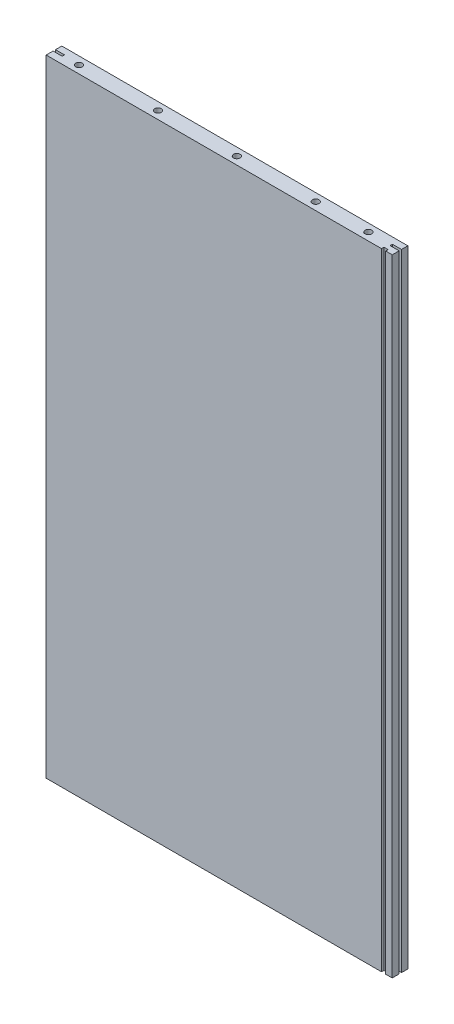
ISO-10303-21;
HEADER;
FILE_DESCRIPTION(('STEP AP214'),'2;1');
FILE_NAME('part.step','',(''),(''),'','','');
FILE_SCHEMA(('AUTOMOTIVE_DESIGN { 1 0 10303 214 1 1 1 1 }'));
ENDSEC;
DATA;
#1=APPLICATION_CONTEXT('core data for automotive mechanical design processes');
#2=APPLICATION_PROTOCOL_DEFINITION('international standard','automotive_design',2000,#1);
#3=PRODUCT_CONTEXT('',#1,'mechanical');
#4=PRODUCT('Part','Part','',(#3));
#5=PRODUCT_RELATED_PRODUCT_CATEGORY('part','',(#4));
#6=PRODUCT_DEFINITION_FORMATION('','',#4);
#7=PRODUCT_DEFINITION_CONTEXT('part definition',#1,'design');
#8=PRODUCT_DEFINITION('design','',#6,#7);
#9=PRODUCT_DEFINITION_SHAPE('','',#8);
#10=(LENGTH_UNIT() NAMED_UNIT(*) SI_UNIT(.MILLI.,.METRE.));
#11=(NAMED_UNIT(*) PLANE_ANGLE_UNIT() SI_UNIT($,.RADIAN.));
#12=(NAMED_UNIT(*) SI_UNIT($,.STERADIAN.) SOLID_ANGLE_UNIT());
#13=UNCERTAINTY_MEASURE_WITH_UNIT(LENGTH_MEASURE(1.E-05),#10,'distance_accuracy_value','');
#14=(GEOMETRIC_REPRESENTATION_CONTEXT(3) GLOBAL_UNCERTAINTY_ASSIGNED_CONTEXT((#13)) GLOBAL_UNIT_ASSIGNED_CONTEXT((#10,
#11,#12)) REPRESENTATION_CONTEXT('',''));
#15=CARTESIAN_POINT('',(0.,0.,0.));
#16=DIRECTION('',(0.,0.,1.));
#17=DIRECTION('',(1.,0.,0.));
#18=AXIS2_PLACEMENT_3D('',#15,#16,#17);
#19=CARTESIAN_POINT('',(-210.5,381.,19.));
#20=DIRECTION('',(0.,-1.,0.));
#21=DIRECTION('',(0.,0.,-1.));
#22=AXIS2_PLACEMENT_3D('',#19,#20,#21);
#23=PLANE('',#22);
#24=CARTESIAN_POINT('',(172.,381.,9.5));
#25=DIRECTION('',(0.,1.,0.));
#26=DIRECTION('',(0.,0.,1.));
#27=AXIS2_PLACEMENT_3D('',#24,#25,#26);
#28=CIRCLE('',#27,3.99999999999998);
#29=CARTESIAN_POINT('',(172.,381.,13.5));
#30=VERTEX_POINT('',#29);
#31=EDGE_CURVE('E281',#30,#30,#28,.T.);
#32=ORIENTED_EDGE('',*,*,#31,.F.);
#33=EDGE_LOOP('',(#32));
#34=FACE_BOUND('',#33,.T.);
#35=CARTESIAN_POINT('',(12.,381.,9.5));
#36=DIRECTION('',(0.,1.,0.));
#37=DIRECTION('',(0.,0.,1.));
#38=AXIS2_PLACEMENT_3D('',#35,#36,#37);
#39=CIRCLE('',#38,3.99999999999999);
#40=CARTESIAN_POINT('',(12.,381.,13.5));
#41=VERTEX_POINT('',#40);
#42=EDGE_CURVE('E298',#41,#41,#39,.T.);
#43=ORIENTED_EDGE('',*,*,#42,.F.);
#44=EDGE_LOOP('',(#43));
#45=FACE_BOUND('',#44,.T.);
#46=CARTESIAN_POINT('',(-84.,381.,9.5));
#47=DIRECTION('',(0.,1.,0.));
#48=DIRECTION('',(0.,0.,1.));
#49=AXIS2_PLACEMENT_3D('',#46,#47,#48);
#50=CIRCLE('',#49,3.99999999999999);
#51=CARTESIAN_POINT('',(-84.,381.,13.5));
#52=VERTEX_POINT('',#51);
#53=EDGE_CURVE('E304',#52,#52,#50,.T.);
#54=ORIENTED_EDGE('',*,*,#53,.F.);
#55=EDGE_LOOP('',(#54));
#56=FACE_BOUND('',#55,.T.);
#57=CARTESIAN_POINT('',(-180.,381.,9.5));
#58=DIRECTION('',(0.,1.,0.));
#59=DIRECTION('',(0.,0.,1.));
#60=AXIS2_PLACEMENT_3D('',#57,#58,#59);
#61=CIRCLE('',#60,4.);
#62=CARTESIAN_POINT('',(-180.,381.,13.5));
#63=VERTEX_POINT('',#62);
#64=EDGE_CURVE('E310',#63,#63,#61,.T.);
#65=ORIENTED_EDGE('',*,*,#64,.F.);
#66=EDGE_LOOP('',(#65));
#67=FACE_BOUND('',#66,.T.);
#68=CARTESIAN_POINT('',(108.,381.,9.5));
#69=DIRECTION('',(0.,1.,0.));
#70=DIRECTION('',(0.,0.,1.));
#71=AXIS2_PLACEMENT_3D('',#68,#69,#70);
#72=CIRCLE('',#71,3.99999999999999);
#73=CARTESIAN_POINT('',(108.,381.,13.5));
#74=VERTEX_POINT('',#73);
#75=EDGE_CURVE('E292',#74,#74,#72,.T.);
#76=ORIENTED_EDGE('',*,*,#75,.F.);
#77=EDGE_LOOP('',(#76));
#78=FACE_BOUND('',#77,.T.);
#79=DIRECTION('',(-1.,0.,0.));
#80=VECTOR('',#79,1.);
#81=CARTESIAN_POINT('',(199.5,381.,7.7));
#82=LINE('',#81,#80);
#83=CARTESIAN_POINT('',(210.5,381.,7.7));
#84=VERTEX_POINT('',#83);
#85=CARTESIAN_POINT('',(199.5,381.,7.7));
#86=VERTEX_POINT('',#85);
#87=EDGE_CURVE('E192',#84,#86,#82,.T.);
#88=ORIENTED_EDGE('',*,*,#87,.F.);
#89=DIRECTION('',(0.,0.,-1.));
#90=VECTOR('',#89,1.);
#91=CARTESIAN_POINT('',(210.5,381.,19.));
#92=LINE('',#91,#90);
#93=CARTESIAN_POINT('',(210.5,381.,0.));
#94=VERTEX_POINT('',#93);
#95=EDGE_CURVE('E41',#84,#94,#92,.T.);
#96=ORIENTED_EDGE('',*,*,#95,.T.);
#97=DIRECTION('',(-1.,0.,0.));
#98=VECTOR('',#97,1.);
#99=CARTESIAN_POINT('',(-210.5,381.,0.));
#100=LINE('',#99,#98);
#101=CARTESIAN_POINT('',(-210.5,381.,0.));
#102=VERTEX_POINT('',#101);
#103=EDGE_CURVE('E228',#94,#102,#100,.T.);
#104=ORIENTED_EDGE('',*,*,#103,.T.);
#105=DIRECTION('',(0.,0.,-1.));
#106=VECTOR('',#105,1.);
#107=CARTESIAN_POINT('',(-210.5,381.,19.));
#108=LINE('',#107,#106);
#109=CARTESIAN_POINT('',(-210.5,381.,7.7));
#110=VERTEX_POINT('',#109);
#111=EDGE_CURVE('E238',#110,#102,#108,.T.);
#112=ORIENTED_EDGE('',*,*,#111,.F.);
#113=DIRECTION('',(1.,0.,0.));
#114=VECTOR('',#113,1.);
#115=CARTESIAN_POINT('',(-199.5,381.,7.7));
#116=LINE('',#115,#114);
#117=CARTESIAN_POINT('',(-199.5,381.,7.7));
#118=VERTEX_POINT('',#117);
#119=EDGE_CURVE('E278',#110,#118,#116,.T.);
#120=ORIENTED_EDGE('',*,*,#119,.T.);
#121=DIRECTION('',(0.,0.,1.));
#122=VECTOR('',#121,1.);
#123=CARTESIAN_POINT('',(-199.5,381.,10.6));
#124=LINE('',#123,#122);
#125=CARTESIAN_POINT('',(-199.5,381.,10.6));
#126=VERTEX_POINT('',#125);
#127=EDGE_CURVE('E385',#118,#126,#124,.T.);
#128=ORIENTED_EDGE('',*,*,#127,.T.);
#129=DIRECTION('',(-1.,0.,0.));
#130=VECTOR('',#129,1.);
#131=CARTESIAN_POINT('',(-210.5,381.,10.6));
#132=LINE('',#131,#130);
#133=CARTESIAN_POINT('',(-210.5,381.,10.6));
#134=VERTEX_POINT('',#133);
#135=EDGE_CURVE('E274',#126,#134,#132,.T.);
#136=ORIENTED_EDGE('',*,*,#135,.T.);
#137=CARTESIAN_POINT('',(-210.5,381.,19.));
#138=VERTEX_POINT('',#137);
#139=EDGE_CURVE('E239',#138,#134,#108,.T.);
#140=ORIENTED_EDGE('',*,*,#139,.F.);
#141=DIRECTION('',(-1.,0.,0.));
#142=VECTOR('',#141,1.);
#143=CARTESIAN_POINT('',(-210.5,381.,19.));
#144=LINE('',#143,#142);
#145=CARTESIAN_POINT('',(197.5,381.,19.));
#146=VERTEX_POINT('',#145);
#147=EDGE_CURVE('E205',#146,#138,#144,.T.);
#148=ORIENTED_EDGE('',*,*,#147,.F.);
#149=DIRECTION('',(0.,0.,-1.));
#150=VECTOR('',#149,1.);
#151=CARTESIAN_POINT('',(197.5,381.,19.));
#152=LINE('',#151,#150);
#153=CARTESIAN_POINT('',(197.5,381.,16.));
#154=VERTEX_POINT('',#153);
#155=EDGE_CURVE('E347',#146,#154,#152,.T.);
#156=ORIENTED_EDGE('',*,*,#155,.T.);
#157=DIRECTION('',(1.,0.,0.));
#158=VECTOR('',#157,1.);
#159=CARTESIAN_POINT('',(197.5,381.,16.));
#160=LINE('',#159,#158);
#161=CARTESIAN_POINT('',(202.5,381.,16.));
#162=VERTEX_POINT('',#161);
#163=EDGE_CURVE('E350',#154,#162,#160,.T.);
#164=ORIENTED_EDGE('',*,*,#163,.T.);
#165=DIRECTION('',(0.,0.,1.));
#166=VECTOR('',#165,1.);
#167=CARTESIAN_POINT('',(202.5,381.,16.));
#168=LINE('',#167,#166);
#169=CARTESIAN_POINT('',(202.5,381.,19.));
#170=VERTEX_POINT('',#169);
#171=EDGE_CURVE('E201',#162,#170,#168,.T.);
#172=ORIENTED_EDGE('',*,*,#171,.T.);
#173=CARTESIAN_POINT('',(210.5,381.,19.));
#174=VERTEX_POINT('',#173);
#175=EDGE_CURVE('E197',#174,#170,#144,.T.);
#176=ORIENTED_EDGE('',*,*,#175,.F.);
#177=CARTESIAN_POINT('',(210.5,381.,10.6));
#178=VERTEX_POINT('',#177);
#179=EDGE_CURVE('E11',#174,#178,#92,.T.);
#180=ORIENTED_EDGE('',*,*,#179,.T.);
#181=DIRECTION('',(1.,0.,0.));
#182=VECTOR('',#181,1.);
#183=CARTESIAN_POINT('',(210.5,381.,10.6));
#184=LINE('',#183,#182);
#185=CARTESIAN_POINT('',(199.5,381.,10.6));
#186=VERTEX_POINT('',#185);
#187=EDGE_CURVE('E177',#186,#178,#184,.T.);
#188=ORIENTED_EDGE('',*,*,#187,.F.);
#189=DIRECTION('',(0.,0.,1.));
#190=VECTOR('',#189,1.);
#191=CARTESIAN_POINT('',(199.5,381.,10.6));
#192=LINE('',#191,#190);
#193=EDGE_CURVE('E182',#86,#186,#192,.T.);
#194=ORIENTED_EDGE('',*,*,#193,.F.);
#195=EDGE_LOOP('',(#88,#96,#104,#112,#120,#128,#136,#140,#148,#156,#164,#172,#176,#180,#188,#194));
#196=FACE_BOUND('',#195,.T.);
#197=ADVANCED_FACE('F33',(#34,#45,#56,#67,#78,#196),#23,.F.);
#198=CARTESIAN_POINT('',(210.5,-381.,19.));
#199=DIRECTION('',(-1.,0.,0.));
#200=DIRECTION('',(0.,0.,1.));
#201=AXIS2_PLACEMENT_3D('',#198,#199,#200);
#202=PLANE('',#201);
#203=DIRECTION('',(0.,-1.,0.));
#204=VECTOR('',#203,1.);
#205=CARTESIAN_POINT('',(210.5,381.,7.7));
#206=LINE('',#205,#204);
#207=CARTESIAN_POINT('',(210.5,-381.,7.7));
#208=VERTEX_POINT('',#207);
#209=EDGE_CURVE('E266',#84,#208,#206,.T.);
#210=ORIENTED_EDGE('',*,*,#209,.T.);
#211=DIRECTION('',(0.,0.,-1.));
#212=VECTOR('',#211,1.);
#213=CARTESIAN_POINT('',(210.5,-381.,19.));
#214=LINE('',#213,#212);
#215=CARTESIAN_POINT('',(210.5,-381.,0.));
#216=VERTEX_POINT('',#215);
#217=EDGE_CURVE('E224',#208,#216,#214,.T.);
#218=ORIENTED_EDGE('',*,*,#217,.T.);
#219=DIRECTION('',(0.,1.,0.));
#220=VECTOR('',#219,1.);
#221=CARTESIAN_POINT('',(210.5,-381.,0.));
#222=LINE('',#221,#220);
#223=EDGE_CURVE('E225',#216,#94,#222,.T.);
#224=ORIENTED_EDGE('',*,*,#223,.T.);
#225=ORIENTED_EDGE('',*,*,#95,.F.);
#226=EDGE_LOOP('',(#210,#218,#224,#225));
#227=FACE_BOUND('',#226,.T.);
#228=ADVANCED_FACE('F35',(#227),#202,.F.);
#229=DIRECTION('',(0.,-1.,0.));
#230=VECTOR('',#229,1.);
#231=CARTESIAN_POINT('',(210.5,381.,10.6));
#232=LINE('',#231,#230);
#233=CARTESIAN_POINT('',(210.5,-381.,10.6));
#234=VERTEX_POINT('',#233);
#235=EDGE_CURVE('E48',#178,#234,#232,.T.);
#236=ORIENTED_EDGE('',*,*,#235,.F.);
#237=ORIENTED_EDGE('',*,*,#179,.F.);
#238=DIRECTION('',(0.,1.,0.));
#239=VECTOR('',#238,1.);
#240=CARTESIAN_POINT('',(210.5,-381.,19.));
#241=LINE('',#240,#239);
#242=CARTESIAN_POINT('',(210.5,-381.,19.));
#243=VERTEX_POINT('',#242);
#244=EDGE_CURVE('E207',#243,#174,#241,.T.);
#245=ORIENTED_EDGE('',*,*,#244,.F.);
#246=EDGE_CURVE('E191',#243,#234,#214,.T.);
#247=ORIENTED_EDGE('',*,*,#246,.T.);
#248=EDGE_LOOP('',(#236,#237,#245,#247));
#249=FACE_BOUND('',#248,.T.);
#250=ADVANCED_FACE('F188',(#249),#202,.F.);
#251=CARTESIAN_POINT('',(-210.5,-381.,19.));
#252=DIRECTION('',(0.,1.,0.));
#253=DIRECTION('',(0.,0.,1.));
#254=AXIS2_PLACEMENT_3D('',#251,#252,#253);
#255=PLANE('',#254);
#256=CARTESIAN_POINT('',(-180.,-381.,9.5));
#257=DIRECTION('',(0.,-1.,0.));
#258=DIRECTION('',(0.,0.,-1.));
#259=AXIS2_PLACEMENT_3D('',#256,#257,#258);
#260=CIRCLE('',#259,4.);
#261=CARTESIAN_POINT('',(-180.,-381.,5.5));
#262=VERTEX_POINT('',#261);
#263=EDGE_CURVE('E340',#262,#262,#260,.T.);
#264=ORIENTED_EDGE('',*,*,#263,.F.);
#265=EDGE_LOOP('',(#264));
#266=FACE_BOUND('',#265,.T.);
#267=CARTESIAN_POINT('',(-84.,-381.,9.5));
#268=DIRECTION('',(0.,-1.,0.));
#269=DIRECTION('',(0.,0.,-1.));
#270=AXIS2_PLACEMENT_3D('',#267,#268,#269);
#271=CIRCLE('',#270,3.99999999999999);
#272=CARTESIAN_POINT('',(-84.,-381.,5.50000000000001));
#273=VERTEX_POINT('',#272);
#274=EDGE_CURVE('E334',#273,#273,#271,.T.);
#275=ORIENTED_EDGE('',*,*,#274,.F.);
#276=EDGE_LOOP('',(#275));
#277=FACE_BOUND('',#276,.T.);
#278=CARTESIAN_POINT('',(12.,-381.,9.5));
#279=DIRECTION('',(0.,-1.,0.));
#280=DIRECTION('',(0.,0.,-1.));
#281=AXIS2_PLACEMENT_3D('',#278,#279,#280);
#282=CIRCLE('',#281,3.99999999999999);
#283=CARTESIAN_POINT('',(12.,-381.,5.50000000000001));
#284=VERTEX_POINT('',#283);
#285=EDGE_CURVE('E328',#284,#284,#282,.T.);
#286=ORIENTED_EDGE('',*,*,#285,.F.);
#287=EDGE_LOOP('',(#286));
#288=FACE_BOUND('',#287,.T.);
#289=CARTESIAN_POINT('',(108.,-381.,9.5));
#290=DIRECTION('',(0.,-1.,0.));
#291=DIRECTION('',(0.,0.,-1.));
#292=AXIS2_PLACEMENT_3D('',#289,#290,#291);
#293=CIRCLE('',#292,3.99999999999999);
#294=CARTESIAN_POINT('',(108.,-381.,5.50000000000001));
#295=VERTEX_POINT('',#294);
#296=EDGE_CURVE('E322',#295,#295,#293,.T.);
#297=ORIENTED_EDGE('',*,*,#296,.F.);
#298=EDGE_LOOP('',(#297));
#299=FACE_BOUND('',#298,.T.);
#300=CARTESIAN_POINT('',(172.,-381.,9.5));
#301=DIRECTION('',(0.,-1.,0.));
#302=DIRECTION('',(0.,0.,-1.));
#303=AXIS2_PLACEMENT_3D('',#300,#301,#302);
#304=CIRCLE('',#303,3.99999999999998);
#305=CARTESIAN_POINT('',(172.,-381.,5.50000000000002));
#306=VERTEX_POINT('',#305);
#307=EDGE_CURVE('E316',#306,#306,#304,.T.);
#308=ORIENTED_EDGE('',*,*,#307,.F.);
#309=EDGE_LOOP('',(#308));
#310=FACE_BOUND('',#309,.T.);
#311=DIRECTION('',(-1.,0.,0.));
#312=VECTOR('',#311,1.);
#313=CARTESIAN_POINT('',(199.5,-381.,7.7));
#314=LINE('',#313,#312);
#315=CARTESIAN_POINT('',(199.5,-381.,7.7));
#316=VERTEX_POINT('',#315);
#317=EDGE_CURVE('E183',#208,#316,#314,.T.);
#318=ORIENTED_EDGE('',*,*,#317,.T.);
#319=DIRECTION('',(0.,0.,1.));
#320=VECTOR('',#319,1.);
#321=CARTESIAN_POINT('',(199.5,-381.,10.6));
#322=LINE('',#321,#320);
#323=CARTESIAN_POINT('',(199.5,-381.,10.6));
#324=VERTEX_POINT('',#323);
#325=EDGE_CURVE('E392',#316,#324,#322,.T.);
#326=ORIENTED_EDGE('',*,*,#325,.T.);
#327=DIRECTION('',(1.,0.,0.));
#328=VECTOR('',#327,1.);
#329=CARTESIAN_POINT('',(210.5,-381.,10.6));
#330=LINE('',#329,#328);
#331=EDGE_CURVE('E395',#324,#234,#330,.T.);
#332=ORIENTED_EDGE('',*,*,#331,.T.);
#333=ORIENTED_EDGE('',*,*,#246,.F.);
#334=DIRECTION('',(1.,0.,0.));
#335=VECTOR('',#334,1.);
#336=CARTESIAN_POINT('',(-210.5,-381.,19.));
#337=LINE('',#336,#335);
#338=CARTESIAN_POINT('',(202.5,-381.,19.));
#339=VERTEX_POINT('',#338);
#340=EDGE_CURVE('E210',#339,#243,#337,.T.);
#341=ORIENTED_EDGE('',*,*,#340,.F.);
#342=DIRECTION('',(0.,0.,1.));
#343=VECTOR('',#342,1.);
#344=CARTESIAN_POINT('',(202.5,-381.,16.));
#345=LINE('',#344,#343);
#346=CARTESIAN_POINT('',(202.5,-381.,16.));
#347=VERTEX_POINT('',#346);
#348=EDGE_CURVE('E351',#347,#339,#345,.T.);
#349=ORIENTED_EDGE('',*,*,#348,.F.);
#350=DIRECTION('',(1.,0.,0.));
#351=VECTOR('',#350,1.);
#352=CARTESIAN_POINT('',(197.5,-381.,16.));
#353=LINE('',#352,#351);
#354=CARTESIAN_POINT('',(197.5,-381.,16.));
#355=VERTEX_POINT('',#354);
#356=EDGE_CURVE('E356',#355,#347,#353,.T.);
#357=ORIENTED_EDGE('',*,*,#356,.F.);
#358=DIRECTION('',(0.,0.,-1.));
#359=VECTOR('',#358,1.);
#360=CARTESIAN_POINT('',(197.5,-381.,19.));
#361=LINE('',#360,#359);
#362=CARTESIAN_POINT('',(197.5,-381.,19.));
#363=VERTEX_POINT('',#362);
#364=EDGE_CURVE('E346',#363,#355,#361,.T.);
#365=ORIENTED_EDGE('',*,*,#364,.F.);
#366=CARTESIAN_POINT('',(-210.5,-381.,19.));
#367=VERTEX_POINT('',#366);
#368=EDGE_CURVE('E221',#367,#363,#337,.T.);
#369=ORIENTED_EDGE('',*,*,#368,.F.);
#370=DIRECTION('',(0.,0.,-1.));
#371=VECTOR('',#370,1.);
#372=CARTESIAN_POINT('',(-210.5,-381.,19.));
#373=LINE('',#372,#371);
#374=CARTESIAN_POINT('',(-210.5,-381.,10.6));
#375=VERTEX_POINT('',#374);
#376=EDGE_CURVE('E236',#367,#375,#373,.T.);
#377=ORIENTED_EDGE('',*,*,#376,.T.);
#378=DIRECTION('',(-1.,0.,0.));
#379=VECTOR('',#378,1.);
#380=CARTESIAN_POINT('',(-210.5,-381.,10.6));
#381=LINE('',#380,#379);
#382=CARTESIAN_POINT('',(-199.5,-381.,10.6));
#383=VERTEX_POINT('',#382);
#384=EDGE_CURVE('E268',#383,#375,#381,.T.);
#385=ORIENTED_EDGE('',*,*,#384,.F.);
#386=DIRECTION('',(0.,0.,1.));
#387=VECTOR('',#386,1.);
#388=CARTESIAN_POINT('',(-199.5,-381.,10.6));
#389=LINE('',#388,#387);
#390=CARTESIAN_POINT('',(-199.5,-381.,7.7));
#391=VERTEX_POINT('',#390);
#392=EDGE_CURVE('E265',#391,#383,#389,.T.);
#393=ORIENTED_EDGE('',*,*,#392,.F.);
#394=DIRECTION('',(1.,0.,0.));
#395=VECTOR('',#394,1.);
#396=CARTESIAN_POINT('',(-199.5,-381.,7.7));
#397=LINE('',#396,#395);
#398=CARTESIAN_POINT('',(-210.5,-381.,7.7));
#399=VERTEX_POINT('',#398);
#400=EDGE_CURVE('E262',#399,#391,#397,.T.);
#401=ORIENTED_EDGE('',*,*,#400,.F.);
#402=CARTESIAN_POINT('',(-210.5,-381.,0.));
#403=VERTEX_POINT('',#402);
#404=EDGE_CURVE('E235',#399,#403,#373,.T.);
#405=ORIENTED_EDGE('',*,*,#404,.T.);
#406=DIRECTION('',(1.,0.,0.));
#407=VECTOR('',#406,1.);
#408=CARTESIAN_POINT('',(-210.5,-381.,0.));
#409=LINE('',#408,#407);
#410=EDGE_CURVE('E211',#403,#216,#409,.T.);
#411=ORIENTED_EDGE('',*,*,#410,.T.);
#412=ORIENTED_EDGE('',*,*,#217,.F.);
#413=EDGE_LOOP('',(#318,#326,#332,#333,#341,#349,#357,#365,#369,#377,#385,#393,#401,#405,#411,#412));
#414=FACE_BOUND('',#413,.T.);
#415=ADVANCED_FACE('F260',(#266,#277,#288,#299,#310,#414),#255,.F.);
#416=CARTESIAN_POINT('',(-210.5,-381.,19.));
#417=DIRECTION('',(1.,0.,0.));
#418=DIRECTION('',(0.,0.,-1.));
#419=AXIS2_PLACEMENT_3D('',#416,#417,#418);
#420=PLANE('',#419);
#421=ORIENTED_EDGE('',*,*,#139,.T.);
#422=DIRECTION('',(0.,-1.,0.));
#423=VECTOR('',#422,1.);
#424=CARTESIAN_POINT('',(-210.5,381.,10.6));
#425=LINE('',#424,#423);
#426=EDGE_CURVE('E279',#134,#375,#425,.T.);
#427=ORIENTED_EDGE('',*,*,#426,.T.);
#428=ORIENTED_EDGE('',*,*,#376,.F.);
#429=DIRECTION('',(0.,-1.,0.));
#430=VECTOR('',#429,1.);
#431=CARTESIAN_POINT('',(-210.5,-381.,19.));
#432=LINE('',#431,#430);
#433=EDGE_CURVE('E204',#138,#367,#432,.T.);
#434=ORIENTED_EDGE('',*,*,#433,.F.);
#435=EDGE_LOOP('',(#421,#427,#428,#434));
#436=FACE_BOUND('',#435,.T.);
#437=ADVANCED_FACE('F376',(#436),#420,.F.);
#438=CARTESIAN_POINT('',(0.,0.,19.));
#439=DIRECTION('',(0.,0.,-1.));
#440=DIRECTION('',(-1.,0.,0.));
#441=AXIS2_PLACEMENT_3D('',#438,#439,#440);
#442=PLANE('',#441);
#443=ORIENTED_EDGE('',*,*,#175,.T.);
#444=DIRECTION('',(0.,-1.,0.));
#445=VECTOR('',#444,1.);
#446=CARTESIAN_POINT('',(202.5,381.,19.));
#447=LINE('',#446,#445);
#448=EDGE_CURVE('E229',#170,#339,#447,.T.);
#449=ORIENTED_EDGE('',*,*,#448,.T.);
#450=ORIENTED_EDGE('',*,*,#340,.T.);
#451=ORIENTED_EDGE('',*,*,#244,.T.);
#452=EDGE_LOOP('',(#443,#449,#450,#451));
#453=FACE_BOUND('',#452,.T.);
#454=ADVANCED_FACE('F208',(#453),#442,.F.);
#455=ORIENTED_EDGE('',*,*,#404,.F.);
#456=DIRECTION('',(0.,-1.,0.));
#457=VECTOR('',#456,1.);
#458=CARTESIAN_POINT('',(-210.5,381.,7.7));
#459=LINE('',#458,#457);
#460=EDGE_CURVE('E56',#110,#399,#459,.T.);
#461=ORIENTED_EDGE('',*,*,#460,.F.);
#462=ORIENTED_EDGE('',*,*,#111,.T.);
#463=DIRECTION('',(0.,-1.,0.));
#464=VECTOR('',#463,1.);
#465=CARTESIAN_POINT('',(-210.5,-381.,0.));
#466=LINE('',#465,#464);
#467=EDGE_CURVE('E214',#102,#403,#466,.T.);
#468=ORIENTED_EDGE('',*,*,#467,.T.);
#469=EDGE_LOOP('',(#455,#461,#462,#468));
#470=FACE_BOUND('',#469,.T.);
#471=ADVANCED_FACE('F248',(#470),#420,.F.);
#472=ORIENTED_EDGE('',*,*,#368,.T.);
#473=DIRECTION('',(0.,-1.,0.));
#474=VECTOR('',#473,1.);
#475=CARTESIAN_POINT('',(197.5,381.,19.));
#476=LINE('',#475,#474);
#477=EDGE_CURVE('E217',#146,#363,#476,.T.);
#478=ORIENTED_EDGE('',*,*,#477,.F.);
#479=ORIENTED_EDGE('',*,*,#147,.T.);
#480=ORIENTED_EDGE('',*,*,#433,.T.);
#481=EDGE_LOOP('',(#472,#478,#479,#480));
#482=FACE_BOUND('',#481,.T.);
#483=ADVANCED_FACE('F374',(#482),#442,.F.);
#484=CARTESIAN_POINT('',(0.,0.,0.));
#485=DIRECTION('',(0.,0.,-1.));
#486=DIRECTION('',(-1.,0.,0.));
#487=AXIS2_PLACEMENT_3D('',#484,#485,#486);
#488=PLANE('',#487);
#489=ORIENTED_EDGE('',*,*,#223,.F.);
#490=ORIENTED_EDGE('',*,*,#410,.F.);
#491=ORIENTED_EDGE('',*,*,#467,.F.);
#492=ORIENTED_EDGE('',*,*,#103,.F.);
#493=EDGE_LOOP('',(#489,#490,#491,#492));
#494=FACE_BOUND('',#493,.T.);
#495=ADVANCED_FACE('F256',(#494),#488,.T.);
#496=CARTESIAN_POINT('',(202.5,381.,16.));
#497=DIRECTION('',(1.,0.,0.));
#498=DIRECTION('',(0.,0.,-1.));
#499=AXIS2_PLACEMENT_3D('',#496,#497,#498);
#500=PLANE('',#499);
#501=ORIENTED_EDGE('',*,*,#348,.T.);
#502=ORIENTED_EDGE('',*,*,#448,.F.);
#503=ORIENTED_EDGE('',*,*,#171,.F.);
#504=DIRECTION('',(0.,-1.,0.));
#505=VECTOR('',#504,1.);
#506=CARTESIAN_POINT('',(202.5,381.,16.));
#507=LINE('',#506,#505);
#508=EDGE_CURVE('E361',#162,#347,#507,.T.);
#509=ORIENTED_EDGE('',*,*,#508,.T.);
#510=EDGE_LOOP('',(#501,#502,#503,#509));
#511=FACE_BOUND('',#510,.T.);
#512=ADVANCED_FACE('F406',(#511),#500,.F.);
#513=CARTESIAN_POINT('',(197.5,381.,16.));
#514=DIRECTION('',(0.,0.,-1.));
#515=DIRECTION('',(-1.,0.,0.));
#516=AXIS2_PLACEMENT_3D('',#513,#514,#515);
#517=PLANE('',#516);
#518=ORIENTED_EDGE('',*,*,#356,.T.);
#519=ORIENTED_EDGE('',*,*,#508,.F.);
#520=ORIENTED_EDGE('',*,*,#163,.F.);
#521=DIRECTION('',(0.,-1.,0.));
#522=VECTOR('',#521,1.);
#523=CARTESIAN_POINT('',(197.5,381.,16.));
#524=LINE('',#523,#522);
#525=EDGE_CURVE('E362',#154,#355,#524,.T.);
#526=ORIENTED_EDGE('',*,*,#525,.T.);
#527=EDGE_LOOP('',(#518,#519,#520,#526));
#528=FACE_BOUND('',#527,.T.);
#529=ADVANCED_FACE('F407',(#528),#517,.F.);
#530=CARTESIAN_POINT('',(197.5,381.,19.));
#531=DIRECTION('',(-1.,0.,0.));
#532=DIRECTION('',(0.,0.,1.));
#533=AXIS2_PLACEMENT_3D('',#530,#531,#532);
#534=PLANE('',#533);
#535=ORIENTED_EDGE('',*,*,#364,.T.);
#536=ORIENTED_EDGE('',*,*,#525,.F.);
#537=ORIENTED_EDGE('',*,*,#155,.F.);
#538=ORIENTED_EDGE('',*,*,#477,.T.);
#539=EDGE_LOOP('',(#535,#536,#537,#538));
#540=FACE_BOUND('',#539,.T.);
#541=ADVANCED_FACE('F368',(#540),#534,.F.);
#542=CARTESIAN_POINT('',(-180.,-354.,9.5));
#543=DIRECTION('',(0.,-1.,0.));
#544=DIRECTION('',(0.,0.,-1.));
#545=AXIS2_PLACEMENT_3D('',#542,#543,#544);
#546=CONICAL_SURFACE('',#545,3.99999999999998,1.02974425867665);
#547=CARTESIAN_POINT('',(-180.,-351.59655752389,9.5));
#548=VERTEX_POINT('',#547);
#549=VERTEX_LOOP('',#548);
#550=FACE_BOUND('',#549,.T.);
#551=CARTESIAN_POINT('',(-180.,-354.,9.5));
#552=DIRECTION('',(0.,-1.,0.));
#553=DIRECTION('',(0.,0.,-1.));
#554=AXIS2_PLACEMENT_3D('',#551,#552,#553);
#555=CIRCLE('',#554,3.99999999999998);
#556=CARTESIAN_POINT('',(-180.,-354.,5.50000000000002));
#557=VERTEX_POINT('',#556);
#558=EDGE_CURVE('E343',#557,#557,#555,.T.);
#559=ORIENTED_EDGE('',*,*,#558,.T.);
#560=EDGE_LOOP('',(#559));
#561=FACE_BOUND('',#560,.T.);
#562=ADVANCED_FACE('F414',(#550,#561),#546,.F.);
#563=CARTESIAN_POINT('',(-180.,-381.,9.5));
#564=DIRECTION('',(0.,-1.,0.));
#565=DIRECTION('',(0.,0.,-1.));
#566=AXIS2_PLACEMENT_3D('',#563,#564,#565);
#567=CYLINDRICAL_SURFACE('',#566,3.99999999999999);
#568=ORIENTED_EDGE('',*,*,#558,.F.);
#569=EDGE_LOOP('',(#568));
#570=FACE_BOUND('',#569,.T.);
#571=ORIENTED_EDGE('',*,*,#263,.T.);
#572=EDGE_LOOP('',(#571));
#573=FACE_BOUND('',#572,.T.);
#574=ADVANCED_FACE('F531',(#570,#573),#567,.F.);
#575=CARTESIAN_POINT('',(-84.,-354.,9.5));
#576=DIRECTION('',(0.,-1.,0.));
#577=DIRECTION('',(0.,0.,-1.));
#578=AXIS2_PLACEMENT_3D('',#575,#576,#577);
#579=CONICAL_SURFACE('',#578,3.99999999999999,1.02974425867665);
#580=CARTESIAN_POINT('',(-84.,-351.59655752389,9.5));
#581=VERTEX_POINT('',#580);
#582=VERTEX_LOOP('',#581);
#583=FACE_BOUND('',#582,.T.);
#584=CARTESIAN_POINT('',(-84.,-354.,9.5));
#585=DIRECTION('',(0.,-1.,0.));
#586=DIRECTION('',(0.,0.,-1.));
#587=AXIS2_PLACEMENT_3D('',#584,#585,#586);
#588=CIRCLE('',#587,3.99999999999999);
#589=CARTESIAN_POINT('',(-84.,-354.,5.50000000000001));
#590=VERTEX_POINT('',#589);
#591=EDGE_CURVE('E337',#590,#590,#588,.T.);
#592=ORIENTED_EDGE('',*,*,#591,.T.);
#593=EDGE_LOOP('',(#592));
#594=FACE_BOUND('',#593,.T.);
#595=ADVANCED_FACE('F540',(#583,#594),#579,.F.);
#596=CARTESIAN_POINT('',(-84.,-381.,9.5));
#597=DIRECTION('',(0.,-1.,0.));
#598=DIRECTION('',(0.,0.,-1.));
#599=AXIS2_PLACEMENT_3D('',#596,#597,#598);
#600=CYLINDRICAL_SURFACE('',#599,3.99999999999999);
#601=ORIENTED_EDGE('',*,*,#591,.F.);
#602=EDGE_LOOP('',(#601));
#603=FACE_BOUND('',#602,.T.);
#604=ORIENTED_EDGE('',*,*,#274,.T.);
#605=EDGE_LOOP('',(#604));
#606=FACE_BOUND('',#605,.T.);
#607=ADVANCED_FACE('F549',(#603,#606),#600,.F.);
#608=CARTESIAN_POINT('',(12.,-354.,9.5));
#609=DIRECTION('',(0.,-1.,0.));
#610=DIRECTION('',(0.,0.,-1.));
#611=AXIS2_PLACEMENT_3D('',#608,#609,#610);
#612=CONICAL_SURFACE('',#611,3.99999999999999,1.02974425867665);
#613=CARTESIAN_POINT('',(12.,-351.59655752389,9.5));
#614=VERTEX_POINT('',#613);
#615=VERTEX_LOOP('',#614);
#616=FACE_BOUND('',#615,.T.);
#617=CARTESIAN_POINT('',(12.,-354.,9.5));
#618=DIRECTION('',(0.,-1.,0.));
#619=DIRECTION('',(0.,0.,-1.));
#620=AXIS2_PLACEMENT_3D('',#617,#618,#619);
#621=CIRCLE('',#620,3.99999999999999);
#622=CARTESIAN_POINT('',(12.,-354.,5.50000000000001));
#623=VERTEX_POINT('',#622);
#624=EDGE_CURVE('E331',#623,#623,#621,.T.);
#625=ORIENTED_EDGE('',*,*,#624,.T.);
#626=EDGE_LOOP('',(#625));
#627=FACE_BOUND('',#626,.T.);
#628=ADVANCED_FACE('F558',(#616,#627),#612,.F.);
#629=CARTESIAN_POINT('',(12.,-381.,9.5));
#630=DIRECTION('',(0.,-1.,0.));
#631=DIRECTION('',(0.,0.,-1.));
#632=AXIS2_PLACEMENT_3D('',#629,#630,#631);
#633=CYLINDRICAL_SURFACE('',#632,3.99999999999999);
#634=ORIENTED_EDGE('',*,*,#624,.F.);
#635=EDGE_LOOP('',(#634));
#636=FACE_BOUND('',#635,.T.);
#637=ORIENTED_EDGE('',*,*,#285,.T.);
#638=EDGE_LOOP('',(#637));
#639=FACE_BOUND('',#638,.T.);
#640=ADVANCED_FACE('F567',(#636,#639),#633,.F.);
#641=CARTESIAN_POINT('',(108.,-354.,9.5));
#642=DIRECTION('',(0.,-1.,0.));
#643=DIRECTION('',(0.,0.,-1.));
#644=AXIS2_PLACEMENT_3D('',#641,#642,#643);
#645=CONICAL_SURFACE('',#644,3.99999999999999,1.02974425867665);
#646=CARTESIAN_POINT('',(108.,-351.59655752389,9.5));
#647=VERTEX_POINT('',#646);
#648=VERTEX_LOOP('',#647);
#649=FACE_BOUND('',#648,.T.);
#650=CARTESIAN_POINT('',(108.,-354.,9.5));
#651=DIRECTION('',(0.,-1.,0.));
#652=DIRECTION('',(0.,0.,-1.));
#653=AXIS2_PLACEMENT_3D('',#650,#651,#652);
#654=CIRCLE('',#653,3.99999999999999);
#655=CARTESIAN_POINT('',(108.,-354.,5.50000000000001));
#656=VERTEX_POINT('',#655);
#657=EDGE_CURVE('E325',#656,#656,#654,.T.);
#658=ORIENTED_EDGE('',*,*,#657,.T.);
#659=EDGE_LOOP('',(#658));
#660=FACE_BOUND('',#659,.T.);
#661=ADVANCED_FACE('F576',(#649,#660),#645,.F.);
#662=CARTESIAN_POINT('',(108.,-381.,9.5));
#663=DIRECTION('',(0.,-1.,0.));
#664=DIRECTION('',(0.,0.,-1.));
#665=AXIS2_PLACEMENT_3D('',#662,#663,#664);
#666=CYLINDRICAL_SURFACE('',#665,3.99999999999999);
#667=ORIENTED_EDGE('',*,*,#657,.F.);
#668=EDGE_LOOP('',(#667));
#669=FACE_BOUND('',#668,.T.);
#670=ORIENTED_EDGE('',*,*,#296,.T.);
#671=EDGE_LOOP('',(#670));
#672=FACE_BOUND('',#671,.T.);
#673=ADVANCED_FACE('F585',(#669,#672),#666,.F.);
#674=CARTESIAN_POINT('',(172.,-354.,9.5));
#675=DIRECTION('',(0.,-1.,0.));
#676=DIRECTION('',(0.,0.,-1.));
#677=AXIS2_PLACEMENT_3D('',#674,#675,#676);
#678=CONICAL_SURFACE('',#677,3.99999999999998,1.02974425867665);
#679=CARTESIAN_POINT('',(172.,-351.59655752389,9.5));
#680=VERTEX_POINT('',#679);
#681=VERTEX_LOOP('',#680);
#682=FACE_BOUND('',#681,.T.);
#683=CARTESIAN_POINT('',(172.,-354.,9.5));
#684=DIRECTION('',(0.,-1.,0.));
#685=DIRECTION('',(0.,0.,-1.));
#686=AXIS2_PLACEMENT_3D('',#683,#684,#685);
#687=CIRCLE('',#686,3.99999999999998);
#688=CARTESIAN_POINT('',(172.,-354.,5.50000000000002));
#689=VERTEX_POINT('',#688);
#690=EDGE_CURVE('E319',#689,#689,#687,.T.);
#691=ORIENTED_EDGE('',*,*,#690,.T.);
#692=EDGE_LOOP('',(#691));
#693=FACE_BOUND('',#692,.T.);
#694=ADVANCED_FACE('F594',(#682,#693),#678,.F.);
#695=CARTESIAN_POINT('',(172.,-381.,9.5));
#696=DIRECTION('',(0.,-1.,0.));
#697=DIRECTION('',(0.,0.,-1.));
#698=AXIS2_PLACEMENT_3D('',#695,#696,#697);
#699=CYLINDRICAL_SURFACE('',#698,3.99999999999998);
#700=ORIENTED_EDGE('',*,*,#690,.F.);
#701=EDGE_LOOP('',(#700));
#702=FACE_BOUND('',#701,.T.);
#703=ORIENTED_EDGE('',*,*,#307,.T.);
#704=EDGE_LOOP('',(#703));
#705=FACE_BOUND('',#704,.T.);
#706=ADVANCED_FACE('F603',(#702,#705),#699,.F.);
#707=CARTESIAN_POINT('',(-180.,354.,9.5));
#708=DIRECTION('',(0.,1.,0.));
#709=DIRECTION('',(0.,0.,1.));
#710=AXIS2_PLACEMENT_3D('',#707,#708,#709);
#711=CONICAL_SURFACE('',#710,3.99999999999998,1.02974425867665);
#712=CARTESIAN_POINT('',(-180.,351.59655752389,9.5));
#713=VERTEX_POINT('',#712);
#714=VERTEX_LOOP('',#713);
#715=FACE_BOUND('',#714,.T.);
#716=CARTESIAN_POINT('',(-180.,354.,9.5));
#717=DIRECTION('',(0.,1.,0.));
#718=DIRECTION('',(0.,0.,1.));
#719=AXIS2_PLACEMENT_3D('',#716,#717,#718);
#720=CIRCLE('',#719,3.99999999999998);
#721=CARTESIAN_POINT('',(-180.,354.,13.5));
#722=VERTEX_POINT('',#721);
#723=EDGE_CURVE('E313',#722,#722,#720,.T.);
#724=ORIENTED_EDGE('',*,*,#723,.T.);
#725=EDGE_LOOP('',(#724));
#726=FACE_BOUND('',#725,.T.);
#727=ADVANCED_FACE('F612',(#715,#726),#711,.F.);
#728=CARTESIAN_POINT('',(-180.,381.,9.5));
#729=DIRECTION('',(0.,1.,0.));
#730=DIRECTION('',(0.,0.,1.));
#731=AXIS2_PLACEMENT_3D('',#728,#729,#730);
#732=CYLINDRICAL_SURFACE('',#731,3.99999999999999);
#733=ORIENTED_EDGE('',*,*,#723,.F.);
#734=EDGE_LOOP('',(#733));
#735=FACE_BOUND('',#734,.T.);
#736=ORIENTED_EDGE('',*,*,#64,.T.);
#737=EDGE_LOOP('',(#736));
#738=FACE_BOUND('',#737,.T.);
#739=ADVANCED_FACE('F621',(#735,#738),#732,.F.);
#740=CARTESIAN_POINT('',(-84.,354.,9.5));
#741=DIRECTION('',(0.,1.,0.));
#742=DIRECTION('',(0.,0.,1.));
#743=AXIS2_PLACEMENT_3D('',#740,#741,#742);
#744=CONICAL_SURFACE('',#743,3.99999999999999,1.02974425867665);
#745=CARTESIAN_POINT('',(-84.,351.59655752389,9.5));
#746=VERTEX_POINT('',#745);
#747=VERTEX_LOOP('',#746);
#748=FACE_BOUND('',#747,.T.);
#749=CARTESIAN_POINT('',(-84.,354.,9.5));
#750=DIRECTION('',(0.,1.,0.));
#751=DIRECTION('',(0.,0.,1.));
#752=AXIS2_PLACEMENT_3D('',#749,#750,#751);
#753=CIRCLE('',#752,3.99999999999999);
#754=CARTESIAN_POINT('',(-84.,354.,13.5));
#755=VERTEX_POINT('',#754);
#756=EDGE_CURVE('E307',#755,#755,#753,.T.);
#757=ORIENTED_EDGE('',*,*,#756,.T.);
#758=EDGE_LOOP('',(#757));
#759=FACE_BOUND('',#758,.T.);
#760=ADVANCED_FACE('F630',(#748,#759),#744,.F.);
#761=CARTESIAN_POINT('',(-84.,381.,9.5));
#762=DIRECTION('',(0.,1.,0.));
#763=DIRECTION('',(0.,0.,1.));
#764=AXIS2_PLACEMENT_3D('',#761,#762,#763);
#765=CYLINDRICAL_SURFACE('',#764,3.99999999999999);
#766=ORIENTED_EDGE('',*,*,#756,.F.);
#767=EDGE_LOOP('',(#766));
#768=FACE_BOUND('',#767,.T.);
#769=ORIENTED_EDGE('',*,*,#53,.T.);
#770=EDGE_LOOP('',(#769));
#771=FACE_BOUND('',#770,.T.);
#772=ADVANCED_FACE('F639',(#768,#771),#765,.F.);
#773=CARTESIAN_POINT('',(12.,354.,9.5));
#774=DIRECTION('',(0.,1.,0.));
#775=DIRECTION('',(0.,0.,1.));
#776=AXIS2_PLACEMENT_3D('',#773,#774,#775);
#777=CONICAL_SURFACE('',#776,3.99999999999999,1.02974425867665);
#778=CARTESIAN_POINT('',(12.,351.59655752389,9.5));
#779=VERTEX_POINT('',#778);
#780=VERTEX_LOOP('',#779);
#781=FACE_BOUND('',#780,.T.);
#782=CARTESIAN_POINT('',(12.,354.,9.5));
#783=DIRECTION('',(0.,1.,0.));
#784=DIRECTION('',(0.,0.,1.));
#785=AXIS2_PLACEMENT_3D('',#782,#783,#784);
#786=CIRCLE('',#785,3.99999999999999);
#787=CARTESIAN_POINT('',(12.,354.,13.5));
#788=VERTEX_POINT('',#787);
#789=EDGE_CURVE('E301',#788,#788,#786,.T.);
#790=ORIENTED_EDGE('',*,*,#789,.T.);
#791=EDGE_LOOP('',(#790));
#792=FACE_BOUND('',#791,.T.);
#793=ADVANCED_FACE('F648',(#781,#792),#777,.F.);
#794=CARTESIAN_POINT('',(12.,381.,9.5));
#795=DIRECTION('',(0.,1.,0.));
#796=DIRECTION('',(0.,0.,1.));
#797=AXIS2_PLACEMENT_3D('',#794,#795,#796);
#798=CYLINDRICAL_SURFACE('',#797,3.99999999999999);
#799=ORIENTED_EDGE('',*,*,#789,.F.);
#800=EDGE_LOOP('',(#799));
#801=FACE_BOUND('',#800,.T.);
#802=ORIENTED_EDGE('',*,*,#42,.T.);
#803=EDGE_LOOP('',(#802));
#804=FACE_BOUND('',#803,.T.);
#805=ADVANCED_FACE('F657',(#801,#804),#798,.F.);
#806=CARTESIAN_POINT('',(108.,354.,9.5));
#807=DIRECTION('',(0.,1.,0.));
#808=DIRECTION('',(0.,0.,1.));
#809=AXIS2_PLACEMENT_3D('',#806,#807,#808);
#810=CONICAL_SURFACE('',#809,3.99999999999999,1.02974425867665);
#811=CARTESIAN_POINT('',(108.,351.59655752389,9.5));
#812=VERTEX_POINT('',#811);
#813=VERTEX_LOOP('',#812);
#814=FACE_BOUND('',#813,.T.);
#815=CARTESIAN_POINT('',(108.,354.,9.5));
#816=DIRECTION('',(0.,1.,0.));
#817=DIRECTION('',(0.,0.,1.));
#818=AXIS2_PLACEMENT_3D('',#815,#816,#817);
#819=CIRCLE('',#818,3.99999999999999);
#820=CARTESIAN_POINT('',(108.,354.,13.5));
#821=VERTEX_POINT('',#820);
#822=EDGE_CURVE('E295',#821,#821,#819,.T.);
#823=ORIENTED_EDGE('',*,*,#822,.T.);
#824=EDGE_LOOP('',(#823));
#825=FACE_BOUND('',#824,.T.);
#826=ADVANCED_FACE('F666',(#814,#825),#810,.F.);
#827=CARTESIAN_POINT('',(108.,381.,9.5));
#828=DIRECTION('',(0.,1.,0.));
#829=DIRECTION('',(0.,0.,1.));
#830=AXIS2_PLACEMENT_3D('',#827,#828,#829);
#831=CYLINDRICAL_SURFACE('',#830,3.99999999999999);
#832=ORIENTED_EDGE('',*,*,#822,.F.);
#833=EDGE_LOOP('',(#832));
#834=FACE_BOUND('',#833,.T.);
#835=ORIENTED_EDGE('',*,*,#75,.T.);
#836=EDGE_LOOP('',(#835));
#837=FACE_BOUND('',#836,.T.);
#838=ADVANCED_FACE('F675',(#834,#837),#831,.F.);
#839=CARTESIAN_POINT('',(172.,354.,9.5));
#840=DIRECTION('',(0.,1.,0.));
#841=DIRECTION('',(0.,0.,1.));
#842=AXIS2_PLACEMENT_3D('',#839,#840,#841);
#843=CONICAL_SURFACE('',#842,3.99999999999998,1.02974425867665);
#844=CARTESIAN_POINT('',(172.,351.59655752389,9.5));
#845=VERTEX_POINT('',#844);
#846=VERTEX_LOOP('',#845);
#847=FACE_BOUND('',#846,.T.);
#848=CARTESIAN_POINT('',(172.,354.,9.5));
#849=DIRECTION('',(0.,1.,0.));
#850=DIRECTION('',(0.,0.,1.));
#851=AXIS2_PLACEMENT_3D('',#848,#849,#850);
#852=CIRCLE('',#851,3.99999999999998);
#853=CARTESIAN_POINT('',(172.,354.,13.5));
#854=VERTEX_POINT('',#853);
#855=EDGE_CURVE('E289',#854,#854,#852,.T.);
#856=ORIENTED_EDGE('',*,*,#855,.T.);
#857=EDGE_LOOP('',(#856));
#858=FACE_BOUND('',#857,.T.);
#859=ADVANCED_FACE('F684',(#847,#858),#843,.F.);
#860=CARTESIAN_POINT('',(172.,381.,9.5));
#861=DIRECTION('',(0.,1.,0.));
#862=DIRECTION('',(0.,0.,1.));
#863=AXIS2_PLACEMENT_3D('',#860,#861,#862);
#864=CYLINDRICAL_SURFACE('',#863,3.99999999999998);
#865=ORIENTED_EDGE('',*,*,#855,.F.);
#866=EDGE_LOOP('',(#865));
#867=FACE_BOUND('',#866,.T.);
#868=ORIENTED_EDGE('',*,*,#31,.T.);
#869=EDGE_LOOP('',(#868));
#870=FACE_BOUND('',#869,.T.);
#871=ADVANCED_FACE('F487',(#867,#870),#864,.F.);
#872=CARTESIAN_POINT('',(-210.5,381.,10.6));
#873=DIRECTION('',(0.,0.,1.));
#874=DIRECTION('',(1.,0.,0.));
#875=AXIS2_PLACEMENT_3D('',#872,#873,#874);
#876=PLANE('',#875);
#877=ORIENTED_EDGE('',*,*,#384,.T.);
#878=ORIENTED_EDGE('',*,*,#426,.F.);
#879=ORIENTED_EDGE('',*,*,#135,.F.);
#880=DIRECTION('',(0.,-1.,0.));
#881=VECTOR('',#880,1.);
#882=CARTESIAN_POINT('',(-199.5,381.,10.6));
#883=LINE('',#882,#881);
#884=EDGE_CURVE('E282',#126,#383,#883,.T.);
#885=ORIENTED_EDGE('',*,*,#884,.T.);
#886=EDGE_LOOP('',(#877,#878,#879,#885));
#887=FACE_BOUND('',#886,.T.);
#888=ADVANCED_FACE('F378',(#887),#876,.F.);
#889=CARTESIAN_POINT('',(-199.5,381.,10.6));
#890=DIRECTION('',(1.,0.,0.));
#891=DIRECTION('',(0.,0.,-1.));
#892=AXIS2_PLACEMENT_3D('',#889,#890,#891);
#893=PLANE('',#892);
#894=ORIENTED_EDGE('',*,*,#392,.T.);
#895=ORIENTED_EDGE('',*,*,#884,.F.);
#896=ORIENTED_EDGE('',*,*,#127,.F.);
#897=DIRECTION('',(0.,-1.,0.));
#898=VECTOR('',#897,1.);
#899=CARTESIAN_POINT('',(-199.5,381.,7.7));
#900=LINE('',#899,#898);
#901=EDGE_CURVE('E284',#118,#391,#900,.T.);
#902=ORIENTED_EDGE('',*,*,#901,.T.);
#903=EDGE_LOOP('',(#894,#895,#896,#902));
#904=FACE_BOUND('',#903,.T.);
#905=ADVANCED_FACE('F384',(#904),#893,.F.);
#906=CARTESIAN_POINT('',(-199.5,381.,7.7));
#907=DIRECTION('',(0.,0.,-1.));
#908=DIRECTION('',(-1.,0.,0.));
#909=AXIS2_PLACEMENT_3D('',#906,#907,#908);
#910=PLANE('',#909);
#911=ORIENTED_EDGE('',*,*,#400,.T.);
#912=ORIENTED_EDGE('',*,*,#901,.F.);
#913=ORIENTED_EDGE('',*,*,#119,.F.);
#914=ORIENTED_EDGE('',*,*,#460,.T.);
#915=EDGE_LOOP('',(#911,#912,#913,#914));
#916=FACE_BOUND('',#915,.T.);
#917=ADVANCED_FACE('F386',(#916),#910,.F.);
#918=CARTESIAN_POINT('',(199.5,381.,7.7));
#919=DIRECTION('',(0.,0.,1.));
#920=DIRECTION('',(1.,0.,0.));
#921=AXIS2_PLACEMENT_3D('',#918,#919,#920);
#922=PLANE('',#921);
#923=ORIENTED_EDGE('',*,*,#317,.F.);
#924=ORIENTED_EDGE('',*,*,#209,.F.);
#925=ORIENTED_EDGE('',*,*,#87,.T.);
#926=DIRECTION('',(0.,-1.,0.));
#927=VECTOR('',#926,1.);
#928=CARTESIAN_POINT('',(199.5,381.,7.7));
#929=LINE('',#928,#927);
#930=EDGE_CURVE('E271',#86,#316,#929,.T.);
#931=ORIENTED_EDGE('',*,*,#930,.T.);
#932=EDGE_LOOP('',(#923,#924,#925,#931));
#933=FACE_BOUND('',#932,.T.);
#934=ADVANCED_FACE('F404',(#933),#922,.T.);
#935=CARTESIAN_POINT('',(199.5,381.,10.6));
#936=DIRECTION('',(1.,0.,0.));
#937=DIRECTION('',(0.,0.,-1.));
#938=AXIS2_PLACEMENT_3D('',#935,#936,#937);
#939=PLANE('',#938);
#940=ORIENTED_EDGE('',*,*,#325,.F.);
#941=ORIENTED_EDGE('',*,*,#930,.F.);
#942=ORIENTED_EDGE('',*,*,#193,.T.);
#943=DIRECTION('',(0.,-1.,0.));
#944=VECTOR('',#943,1.);
#945=CARTESIAN_POINT('',(199.5,381.,10.6));
#946=LINE('',#945,#944);
#947=EDGE_CURVE('E179',#186,#324,#946,.T.);
#948=ORIENTED_EDGE('',*,*,#947,.T.);
#949=EDGE_LOOP('',(#940,#941,#942,#948));
#950=FACE_BOUND('',#949,.T.);
#951=ADVANCED_FACE('F401',(#950),#939,.T.);
#952=CARTESIAN_POINT('',(210.5,381.,10.6));
#953=DIRECTION('',(0.,0.,-1.));
#954=DIRECTION('',(-1.,0.,0.));
#955=AXIS2_PLACEMENT_3D('',#952,#953,#954);
#956=PLANE('',#955);
#957=ORIENTED_EDGE('',*,*,#331,.F.);
#958=ORIENTED_EDGE('',*,*,#947,.F.);
#959=ORIENTED_EDGE('',*,*,#187,.T.);
#960=ORIENTED_EDGE('',*,*,#235,.T.);
#961=EDGE_LOOP('',(#957,#958,#959,#960));
#962=FACE_BOUND('',#961,.T.);
#963=ADVANCED_FACE('F178',(#962),#956,.T.);
#964=CLOSED_SHELL('',(#197,#228,#250,#415,#437,#454,#471,#483,#495,#512,#529,#541,#562,#574,
#595,#607,#628,#640,#661,#673,#694,#706,#727,#739,#760,#772,#793,#805,#826,#838,#859,#871,#888,
#905,#917,#934,#951,#963));
#965=MANIFOLD_SOLID_BREP('B2',#964);
#966=ADVANCED_BREP_SHAPE_REPRESENTATION('',(#18,#965),#14);
#967=SHAPE_DEFINITION_REPRESENTATION(#9,#966);
ENDSEC;
END-ISO-10303-21;
